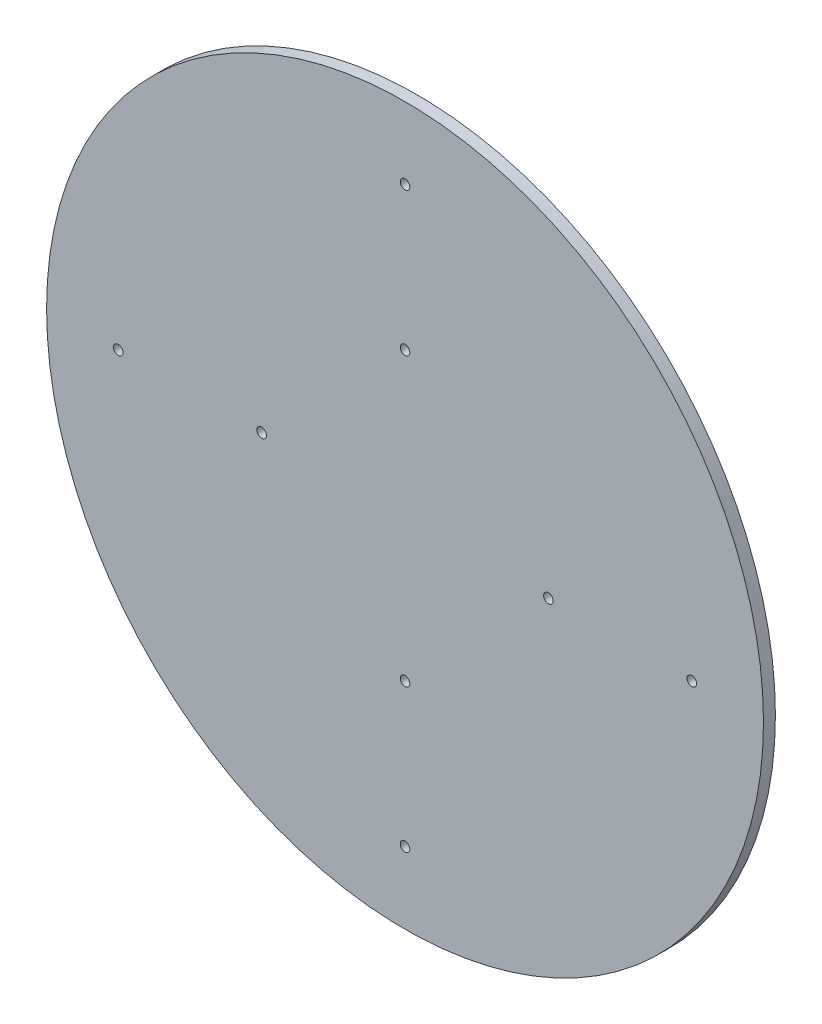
ISO-10303-21;
HEADER;
FILE_DESCRIPTION(('STEP AP214'),'2;1');
FILE_NAME('part.step','',(''),(''),'','','');
FILE_SCHEMA(('AUTOMOTIVE_DESIGN { 1 0 10303 214 1 1 1 1 }'));
ENDSEC;
DATA;
#1=APPLICATION_CONTEXT('core data for automotive mechanical design processes');
#2=APPLICATION_PROTOCOL_DEFINITION('international standard','automotive_design',2000,#1);
#3=PRODUCT_CONTEXT('',#1,'mechanical');
#4=PRODUCT('Part','Part','',(#3));
#5=PRODUCT_RELATED_PRODUCT_CATEGORY('part','',(#4));
#6=PRODUCT_DEFINITION_FORMATION('','',#4);
#7=PRODUCT_DEFINITION_CONTEXT('part definition',#1,'design');
#8=PRODUCT_DEFINITION('design','',#6,#7);
#9=PRODUCT_DEFINITION_SHAPE('','',#8);
#10=(LENGTH_UNIT() NAMED_UNIT(*) SI_UNIT(.MILLI.,.METRE.));
#11=(NAMED_UNIT(*) PLANE_ANGLE_UNIT() SI_UNIT($,.RADIAN.));
#12=(NAMED_UNIT(*) SI_UNIT($,.STERADIAN.) SOLID_ANGLE_UNIT());
#13=UNCERTAINTY_MEASURE_WITH_UNIT(LENGTH_MEASURE(1.E-05),#10,'distance_accuracy_value','');
#14=(GEOMETRIC_REPRESENTATION_CONTEXT(3) GLOBAL_UNCERTAINTY_ASSIGNED_CONTEXT((#13)) GLOBAL_UNIT_ASSIGNED_CONTEXT((#10,
#11,#12)) REPRESENTATION_CONTEXT('',''));
#15=CARTESIAN_POINT('',(0.,0.,0.));
#16=DIRECTION('',(0.,0.,1.));
#17=DIRECTION('',(1.,0.,0.));
#18=AXIS2_PLACEMENT_3D('',#15,#16,#17);
#19=CARTESIAN_POINT('',(0.,0.,5.));
#20=DIRECTION('',(0.,0.,-1.));
#21=DIRECTION('',(-1.,0.,0.));
#22=AXIS2_PLACEMENT_3D('',#19,#20,#21);
#23=CYLINDRICAL_SURFACE('',#22,150.);
#24=CARTESIAN_POINT('',(0.,0.,5.));
#25=DIRECTION('',(0.,0.,1.));
#26=DIRECTION('',(1.,0.,0.));
#27=AXIS2_PLACEMENT_3D('',#24,#25,#26);
#28=CIRCLE('',#27,150.);
#29=CARTESIAN_POINT('',(150.,0.,5.));
#30=VERTEX_POINT('',#29);
#31=EDGE_CURVE('E10',#30,#30,#28,.T.);
#32=ORIENTED_EDGE('',*,*,#31,.F.);
#33=EDGE_LOOP('',(#32));
#34=FACE_BOUND('',#33,.T.);
#35=CARTESIAN_POINT('',(0.,0.,0.));
#36=DIRECTION('',(0.,0.,1.));
#37=DIRECTION('',(1.,0.,0.));
#38=AXIS2_PLACEMENT_3D('',#35,#36,#37);
#39=CIRCLE('',#38,150.);
#40=CARTESIAN_POINT('',(150.,0.,0.));
#41=VERTEX_POINT('',#40);
#42=EDGE_CURVE('E40',#41,#41,#39,.T.);
#43=ORIENTED_EDGE('',*,*,#42,.T.);
#44=EDGE_LOOP('',(#43));
#45=FACE_BOUND('',#44,.T.);
#46=ADVANCED_FACE('F37',(#34,#45),#23,.T.);
#47=CARTESIAN_POINT('',(0.,0.,5.));
#48=DIRECTION('',(0.,0.,1.));
#49=DIRECTION('',(1.,0.,0.));
#50=AXIS2_PLACEMENT_3D('',#47,#48,#49);
#51=PLANE('',#50);
#52=CARTESIAN_POINT('',(120.,1.25693328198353E-12,5.));
#53=DIRECTION('',(0.,0.,1.));
#54=DIRECTION('',(1.,0.,0.));
#55=AXIS2_PLACEMENT_3D('',#52,#53,#54);
#56=CIRCLE('',#55,2.);
#57=CARTESIAN_POINT('',(122.,1.25693328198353E-12,5.));
#58=VERTEX_POINT('',#57);
#59=EDGE_CURVE('E110',#58,#58,#56,.T.);
#60=ORIENTED_EDGE('',*,*,#59,.F.);
#61=EDGE_LOOP('',(#60));
#62=FACE_BOUND('',#61,.T.);
#63=CARTESIAN_POINT('',(0.,-120.,5.));
#64=DIRECTION('',(0.,0.,1.));
#65=DIRECTION('',(1.,0.,0.));
#66=AXIS2_PLACEMENT_3D('',#63,#64,#65);
#67=CIRCLE('',#66,2.);
#68=CARTESIAN_POINT('',(2.,-120.,5.));
#69=VERTEX_POINT('',#68);
#70=EDGE_CURVE('E102',#69,#69,#67,.T.);
#71=ORIENTED_EDGE('',*,*,#70,.F.);
#72=EDGE_LOOP('',(#71));
#73=FACE_BOUND('',#72,.T.);
#74=CARTESIAN_POINT('',(-120.,-4.18977760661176E-13,5.));
#75=DIRECTION('',(0.,0.,1.));
#76=DIRECTION('',(1.,0.,0.));
#77=AXIS2_PLACEMENT_3D('',#74,#75,#76);
#78=CIRCLE('',#77,2.);
#79=CARTESIAN_POINT('',(-118.,-4.18977760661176E-13,5.));
#80=VERTEX_POINT('',#79);
#81=EDGE_CURVE('E94',#80,#80,#78,.T.);
#82=ORIENTED_EDGE('',*,*,#81,.F.);
#83=EDGE_LOOP('',(#82));
#84=FACE_BOUND('',#83,.T.);
#85=CARTESIAN_POINT('',(60.,6.28466640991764E-13,5.));
#86=DIRECTION('',(0.,0.,1.));
#87=DIRECTION('',(1.,0.,0.));
#88=AXIS2_PLACEMENT_3D('',#85,#86,#87);
#89=CIRCLE('',#88,2.);
#90=CARTESIAN_POINT('',(62.,6.28466640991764E-13,5.));
#91=VERTEX_POINT('',#90);
#92=EDGE_CURVE('E86',#91,#91,#89,.T.);
#93=ORIENTED_EDGE('',*,*,#92,.F.);
#94=EDGE_LOOP('',(#93));
#95=FACE_BOUND('',#94,.T.);
#96=CARTESIAN_POINT('',(0.,-60.,5.));
#97=DIRECTION('',(0.,0.,1.));
#98=DIRECTION('',(1.,0.,0.));
#99=AXIS2_PLACEMENT_3D('',#96,#97,#98);
#100=CIRCLE('',#99,2.);
#101=CARTESIAN_POINT('',(2.,-60.,5.));
#102=VERTEX_POINT('',#101);
#103=EDGE_CURVE('E78',#102,#102,#100,.T.);
#104=ORIENTED_EDGE('',*,*,#103,.F.);
#105=EDGE_LOOP('',(#104));
#106=FACE_BOUND('',#105,.T.);
#107=CARTESIAN_POINT('',(-60.,-2.09488880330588E-13,5.));
#108=DIRECTION('',(0.,0.,1.));
#109=DIRECTION('',(1.,0.,0.));
#110=AXIS2_PLACEMENT_3D('',#107,#108,#109);
#111=CIRCLE('',#110,2.);
#112=CARTESIAN_POINT('',(-58.,-2.09488880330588E-13,5.));
#113=VERTEX_POINT('',#112);
#114=EDGE_CURVE('E70',#113,#113,#111,.T.);
#115=ORIENTED_EDGE('',*,*,#114,.F.);
#116=EDGE_LOOP('',(#115));
#117=FACE_BOUND('',#116,.T.);
#118=CARTESIAN_POINT('',(0.,120.,5.));
#119=DIRECTION('',(0.,0.,1.));
#120=DIRECTION('',(1.,0.,0.));
#121=AXIS2_PLACEMENT_3D('',#118,#119,#120);
#122=CIRCLE('',#121,2.);
#123=CARTESIAN_POINT('',(2.,120.,5.));
#124=VERTEX_POINT('',#123);
#125=EDGE_CURVE('E62',#124,#124,#122,.T.);
#126=ORIENTED_EDGE('',*,*,#125,.F.);
#127=EDGE_LOOP('',(#126));
#128=FACE_BOUND('',#127,.T.);
#129=CARTESIAN_POINT('',(0.,60.,5.));
#130=DIRECTION('',(0.,0.,1.));
#131=DIRECTION('',(1.,0.,0.));
#132=AXIS2_PLACEMENT_3D('',#129,#130,#131);
#133=CIRCLE('',#132,2.);
#134=CARTESIAN_POINT('',(2.,60.,5.));
#135=VERTEX_POINT('',#134);
#136=EDGE_CURVE('E54',#135,#135,#133,.T.);
#137=ORIENTED_EDGE('',*,*,#136,.F.);
#138=EDGE_LOOP('',(#137));
#139=FACE_BOUND('',#138,.T.);
#140=ORIENTED_EDGE('',*,*,#31,.T.);
#141=EDGE_LOOP('',(#140));
#142=FACE_BOUND('',#141,.T.);
#143=ADVANCED_FACE('F117',(#62,#73,#84,#95,#106,#117,#128,#139,#142),#51,.T.);
#144=CARTESIAN_POINT('',(0.,0.,0.));
#145=DIRECTION('',(0.,0.,1.));
#146=DIRECTION('',(1.,0.,0.));
#147=AXIS2_PLACEMENT_3D('',#144,#145,#146);
#148=PLANE('',#147);
#149=CARTESIAN_POINT('',(120.,1.25693328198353E-12,0.));
#150=DIRECTION('',(0.,0.,1.));
#151=DIRECTION('',(1.,0.,0.));
#152=AXIS2_PLACEMENT_3D('',#149,#150,#151);
#153=CIRCLE('',#152,2.);
#154=CARTESIAN_POINT('',(122.,1.25693328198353E-12,0.));
#155=VERTEX_POINT('',#154);
#156=EDGE_CURVE('E106',#155,#155,#153,.T.);
#157=ORIENTED_EDGE('',*,*,#156,.T.);
#158=EDGE_LOOP('',(#157));
#159=FACE_BOUND('',#158,.T.);
#160=CARTESIAN_POINT('',(0.,-120.,0.));
#161=DIRECTION('',(0.,0.,1.));
#162=DIRECTION('',(1.,0.,0.));
#163=AXIS2_PLACEMENT_3D('',#160,#161,#162);
#164=CIRCLE('',#163,2.);
#165=CARTESIAN_POINT('',(2.,-120.,0.));
#166=VERTEX_POINT('',#165);
#167=EDGE_CURVE('E98',#166,#166,#164,.T.);
#168=ORIENTED_EDGE('',*,*,#167,.T.);
#169=EDGE_LOOP('',(#168));
#170=FACE_BOUND('',#169,.T.);
#171=CARTESIAN_POINT('',(-120.,-4.18977760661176E-13,0.));
#172=DIRECTION('',(0.,0.,1.));
#173=DIRECTION('',(1.,0.,0.));
#174=AXIS2_PLACEMENT_3D('',#171,#172,#173);
#175=CIRCLE('',#174,2.);
#176=CARTESIAN_POINT('',(-118.,-4.18977760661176E-13,0.));
#177=VERTEX_POINT('',#176);
#178=EDGE_CURVE('E90',#177,#177,#175,.T.);
#179=ORIENTED_EDGE('',*,*,#178,.T.);
#180=EDGE_LOOP('',(#179));
#181=FACE_BOUND('',#180,.T.);
#182=CARTESIAN_POINT('',(60.,6.28466640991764E-13,0.));
#183=DIRECTION('',(0.,0.,1.));
#184=DIRECTION('',(1.,0.,0.));
#185=AXIS2_PLACEMENT_3D('',#182,#183,#184);
#186=CIRCLE('',#185,2.);
#187=CARTESIAN_POINT('',(62.,6.28466640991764E-13,0.));
#188=VERTEX_POINT('',#187);
#189=EDGE_CURVE('E82',#188,#188,#186,.T.);
#190=ORIENTED_EDGE('',*,*,#189,.T.);
#191=EDGE_LOOP('',(#190));
#192=FACE_BOUND('',#191,.T.);
#193=CARTESIAN_POINT('',(0.,-60.,0.));
#194=DIRECTION('',(0.,0.,1.));
#195=DIRECTION('',(1.,0.,0.));
#196=AXIS2_PLACEMENT_3D('',#193,#194,#195);
#197=CIRCLE('',#196,2.);
#198=CARTESIAN_POINT('',(2.,-60.,0.));
#199=VERTEX_POINT('',#198);
#200=EDGE_CURVE('E74',#199,#199,#197,.T.);
#201=ORIENTED_EDGE('',*,*,#200,.T.);
#202=EDGE_LOOP('',(#201));
#203=FACE_BOUND('',#202,.T.);
#204=CARTESIAN_POINT('',(-60.,-2.09488880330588E-13,0.));
#205=DIRECTION('',(0.,0.,1.));
#206=DIRECTION('',(1.,0.,0.));
#207=AXIS2_PLACEMENT_3D('',#204,#205,#206);
#208=CIRCLE('',#207,2.);
#209=CARTESIAN_POINT('',(-58.,-2.09488880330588E-13,0.));
#210=VERTEX_POINT('',#209);
#211=EDGE_CURVE('E66',#210,#210,#208,.T.);
#212=ORIENTED_EDGE('',*,*,#211,.T.);
#213=EDGE_LOOP('',(#212));
#214=FACE_BOUND('',#213,.T.);
#215=CARTESIAN_POINT('',(0.,120.,0.));
#216=DIRECTION('',(0.,0.,1.));
#217=DIRECTION('',(1.,0.,0.));
#218=AXIS2_PLACEMENT_3D('',#215,#216,#217);
#219=CIRCLE('',#218,2.);
#220=CARTESIAN_POINT('',(2.,120.,0.));
#221=VERTEX_POINT('',#220);
#222=EDGE_CURVE('E58',#221,#221,#219,.T.);
#223=ORIENTED_EDGE('',*,*,#222,.T.);
#224=EDGE_LOOP('',(#223));
#225=FACE_BOUND('',#224,.T.);
#226=CARTESIAN_POINT('',(0.,60.,0.));
#227=DIRECTION('',(0.,0.,1.));
#228=DIRECTION('',(1.,0.,0.));
#229=AXIS2_PLACEMENT_3D('',#226,#227,#228);
#230=CIRCLE('',#229,2.);
#231=CARTESIAN_POINT('',(2.,60.,0.));
#232=VERTEX_POINT('',#231);
#233=EDGE_CURVE('E49',#232,#232,#230,.T.);
#234=ORIENTED_EDGE('',*,*,#233,.T.);
#235=EDGE_LOOP('',(#234));
#236=FACE_BOUND('',#235,.T.);
#237=ORIENTED_EDGE('',*,*,#42,.F.);
#238=EDGE_LOOP('',(#237));
#239=FACE_BOUND('',#238,.T.);
#240=ADVANCED_FACE('F120',(#159,#170,#181,#192,#203,#214,#225,#236,#239),#148,.F.);
#241=CARTESIAN_POINT('',(0.,60.,5.));
#242=DIRECTION('',(0.,0.,1.));
#243=DIRECTION('',(1.,0.,0.));
#244=AXIS2_PLACEMENT_3D('',#241,#242,#243);
#245=CYLINDRICAL_SURFACE('',#244,2.);
#246=ORIENTED_EDGE('',*,*,#233,.F.);
#247=EDGE_LOOP('',(#246));
#248=FACE_BOUND('',#247,.T.);
#249=ORIENTED_EDGE('',*,*,#136,.T.);
#250=EDGE_LOOP('',(#249));
#251=FACE_BOUND('',#250,.T.);
#252=ADVANCED_FACE('F136',(#248,#251),#245,.F.);
#253=CARTESIAN_POINT('',(0.,120.,5.));
#254=DIRECTION('',(0.,0.,1.));
#255=DIRECTION('',(1.,0.,0.));
#256=AXIS2_PLACEMENT_3D('',#253,#254,#255);
#257=CYLINDRICAL_SURFACE('',#256,2.);
#258=ORIENTED_EDGE('',*,*,#222,.F.);
#259=EDGE_LOOP('',(#258));
#260=FACE_BOUND('',#259,.T.);
#261=ORIENTED_EDGE('',*,*,#125,.T.);
#262=EDGE_LOOP('',(#261));
#263=FACE_BOUND('',#262,.T.);
#264=ADVANCED_FACE('F138',(#260,#263),#257,.F.);
#265=CARTESIAN_POINT('',(-60.,-2.09488880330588E-13,5.));
#266=DIRECTION('',(0.,0.,1.));
#267=DIRECTION('',(1.,0.,0.));
#268=AXIS2_PLACEMENT_3D('',#265,#266,#267);
#269=CYLINDRICAL_SURFACE('',#268,2.);
#270=ORIENTED_EDGE('',*,*,#211,.F.);
#271=EDGE_LOOP('',(#270));
#272=FACE_BOUND('',#271,.T.);
#273=ORIENTED_EDGE('',*,*,#114,.T.);
#274=EDGE_LOOP('',(#273));
#275=FACE_BOUND('',#274,.T.);
#276=ADVANCED_FACE('F145',(#272,#275),#269,.F.);
#277=CARTESIAN_POINT('',(0.,-60.,5.));
#278=DIRECTION('',(0.,0.,1.));
#279=DIRECTION('',(1.,0.,0.));
#280=AXIS2_PLACEMENT_3D('',#277,#278,#279);
#281=CYLINDRICAL_SURFACE('',#280,2.);
#282=ORIENTED_EDGE('',*,*,#200,.F.);
#283=EDGE_LOOP('',(#282));
#284=FACE_BOUND('',#283,.T.);
#285=ORIENTED_EDGE('',*,*,#103,.T.);
#286=EDGE_LOOP('',(#285));
#287=FACE_BOUND('',#286,.T.);
#288=ADVANCED_FACE('F176',(#284,#287),#281,.F.);
#289=CARTESIAN_POINT('',(60.,6.28466640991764E-13,5.));
#290=DIRECTION('',(0.,0.,1.));
#291=DIRECTION('',(1.,0.,0.));
#292=AXIS2_PLACEMENT_3D('',#289,#290,#291);
#293=CYLINDRICAL_SURFACE('',#292,2.);
#294=ORIENTED_EDGE('',*,*,#189,.F.);
#295=EDGE_LOOP('',(#294));
#296=FACE_BOUND('',#295,.T.);
#297=ORIENTED_EDGE('',*,*,#92,.T.);
#298=EDGE_LOOP('',(#297));
#299=FACE_BOUND('',#298,.T.);
#300=ADVANCED_FACE('F187',(#296,#299),#293,.F.);
#301=CARTESIAN_POINT('',(-120.,-4.18977760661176E-13,5.));
#302=DIRECTION('',(0.,0.,1.));
#303=DIRECTION('',(1.,0.,0.));
#304=AXIS2_PLACEMENT_3D('',#301,#302,#303);
#305=CYLINDRICAL_SURFACE('',#304,2.);
#306=ORIENTED_EDGE('',*,*,#178,.F.);
#307=EDGE_LOOP('',(#306));
#308=FACE_BOUND('',#307,.T.);
#309=ORIENTED_EDGE('',*,*,#81,.T.);
#310=EDGE_LOOP('',(#309));
#311=FACE_BOUND('',#310,.T.);
#312=ADVANCED_FACE('F197',(#308,#311),#305,.F.);
#313=CARTESIAN_POINT('',(0.,-120.,5.));
#314=DIRECTION('',(0.,0.,1.));
#315=DIRECTION('',(1.,0.,0.));
#316=AXIS2_PLACEMENT_3D('',#313,#314,#315);
#317=CYLINDRICAL_SURFACE('',#316,2.);
#318=ORIENTED_EDGE('',*,*,#167,.F.);
#319=EDGE_LOOP('',(#318));
#320=FACE_BOUND('',#319,.T.);
#321=ORIENTED_EDGE('',*,*,#70,.T.);
#322=EDGE_LOOP('',(#321));
#323=FACE_BOUND('',#322,.T.);
#324=ADVANCED_FACE('F207',(#320,#323),#317,.F.);
#325=CARTESIAN_POINT('',(120.,1.25693328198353E-12,5.));
#326=DIRECTION('',(0.,0.,1.));
#327=DIRECTION('',(1.,0.,0.));
#328=AXIS2_PLACEMENT_3D('',#325,#326,#327);
#329=CYLINDRICAL_SURFACE('',#328,2.);
#330=ORIENTED_EDGE('',*,*,#156,.F.);
#331=EDGE_LOOP('',(#330));
#332=FACE_BOUND('',#331,.T.);
#333=ORIENTED_EDGE('',*,*,#59,.T.);
#334=EDGE_LOOP('',(#333));
#335=FACE_BOUND('',#334,.T.);
#336=ADVANCED_FACE('F115',(#332,#335),#329,.F.);
#337=CLOSED_SHELL('',(#46,#143,#240,#252,#264,#276,#288,#300,#312,#324,#336));
#338=MANIFOLD_SOLID_BREP('B2',#337);
#339=ADVANCED_BREP_SHAPE_REPRESENTATION('',(#18,#338),#14);
#340=SHAPE_DEFINITION_REPRESENTATION(#9,#339);
ENDSEC;
END-ISO-10303-21;
